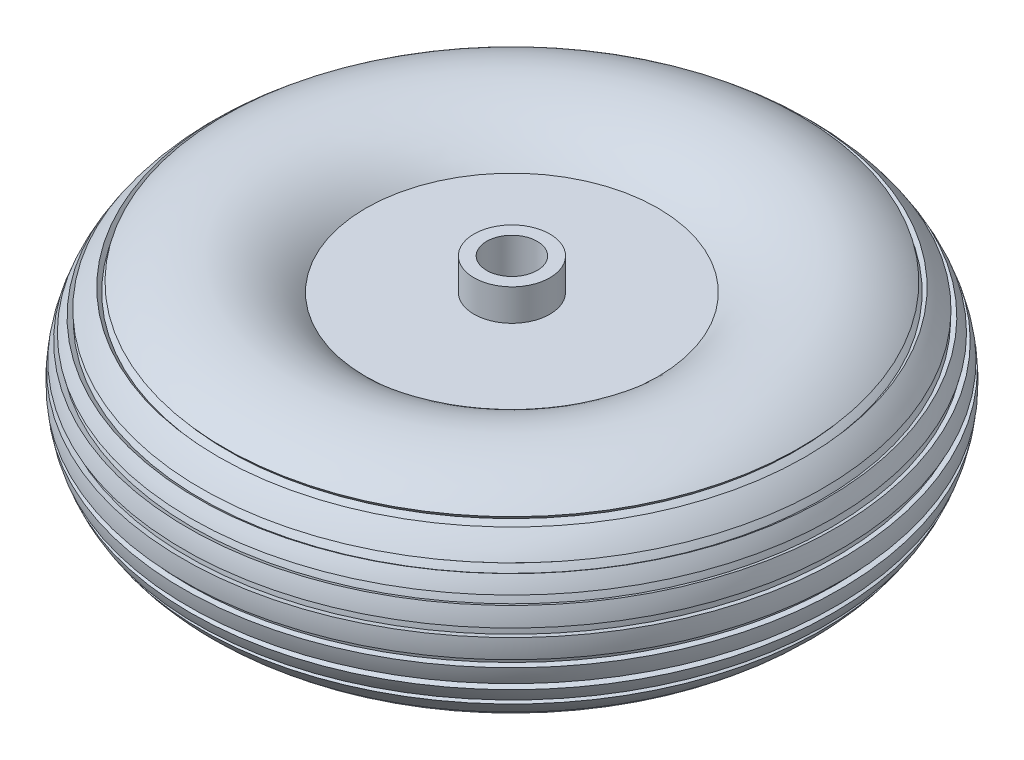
from build123d import *

# Parameters (mm, degrees)
SKETCH3_R           = 15
SKETCH3_R_2         = 10
BOSS_EXTRUDE1_DEPTH = 12.5
BOSS_EXTRUDE2_START = 12.5
SKETCH4_R           = 15
SKETCH4_R_2         = 10
BOSS_EXTRUDE2_DEPTH = 12.5


with BuildPart() as part:
    # Sketch2 → Revolve1 (revolve)
    with BuildSketch(Plane.YZ, mode=Mode.PRIVATE) as revolve1_sk:
        with BuildLine():
            ThreePointArc((-3.467976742, 62.934142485), (-4.969540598, 62.776480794), (-6.464166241, 62.562832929))
            Line((-6.464166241, 62.562832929), (-6.798959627, 64.628658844))
            ThreePointArc((-6.798959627, 64.628658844), (-10.127953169, 63.951609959), (-13.392236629, 63.010840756))
            Line((-13.392236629, 63.010840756), (-12.59221219, 61.071065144))
            ThreePointArc((-12.59221219, 61.071065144), (-14.008930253, 60.577117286), (-15.406334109, 60.030914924))
            Line((-15.406334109, 60.030914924), (-16.204262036, 61.965607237))
            ThreePointArc((-16.204262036, 61.965607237), (-18.972648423, 60.706118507), (-21.643870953, 59.251867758))
            Line((-21.643870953, 59.251867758), (-20.480648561, 57.508280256))
            ThreePointArc((-20.480648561, 57.508280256), (-21.744958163, 56.733326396), (-22.979980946, 55.912503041))
            Line((-22.979980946, 55.912503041), (-24.170164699, 57.633893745))
            ThreePointArc((-24.170164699, 57.633893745), (-28.149638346, 54.516994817), (-31.730906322, 50.949672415))
            Line((-31.730906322, 50.949672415), (-30.168417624, 49.557425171))
            ThreePointArc((-30.168417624, 49.557425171), (-31.121960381, 48.447456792), (-32.034688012, 47.303690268))
            Line((-32.034688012, 47.303690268), (-33.64639754, 48.64079966))
            ThreePointArc((-33.64639754, 48.64079966), (-42.41040785, 19.917882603), (-30, -7.427969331))
            Line((-30, -7.427969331), (-30, -51.79482847))
            Line((-30, -51.79482847), (-30, -55.176017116))
            Line((-30, -55.176017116), (30, -55.176017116))
            Line((30, -55.176017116), (30, -51.79482847))
            Line((30, -51.79482847), (30, -20.176017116))
            Line((30, -20.176017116), (30, -7.427969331))
            ThreePointArc((30, -7.427969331), (42.41040785, 19.917882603), (33.64639754, 48.64079966))
            Line((33.64639754, 48.64079966), (32.034688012, 47.303690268))
            ThreePointArc((32.034688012, 47.303690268), (31.121960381, 48.447456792), (30.168417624, 49.557425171))
            Line((30.168417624, 49.557425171), (31.730906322, 50.949672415))
            ThreePointArc((31.730906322, 50.949672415), (28.149638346, 54.516994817), (24.170164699, 57.633893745))
            Line((24.170164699, 57.633893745), (22.979980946, 55.912503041))
            ThreePointArc((22.979980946, 55.912503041), (21.744958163, 56.733326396), (20.480648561, 57.508280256))
            Line((20.480648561, 57.508280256), (21.643870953, 59.251867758))
            ThreePointArc((21.643870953, 59.251867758), (18.972648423, 60.706118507), (16.204262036, 61.965607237))
            Line((16.204262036, 61.965607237), (15.406334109, 60.030914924))
            ThreePointArc((15.406334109, 60.030914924), (14.008930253, 60.577117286), (12.59221219, 61.071065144))
            Line((12.59221219, 61.071065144), (13.392236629, 63.010840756))
            ThreePointArc((13.392236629, 63.010840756), (10.127953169, 63.951609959), (6.798959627, 64.628658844))
            Line((6.798959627, 64.628658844), (6.464166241, 62.562832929))
            ThreePointArc((6.464166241, 62.562832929), (4.969540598, 62.776480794), (3.467976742, 62.934142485))
            Line((3.467976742, 62.934142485), (3.798959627, 65.005887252))
            ThreePointArc((3.798959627, 65.005887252), (0, 65.176017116), (-3.798959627, 65.005887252))
            Line((-3.798959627, 65.005887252), (-3.467976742, 62.934142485))
        make_face()
    revolve(revolve1_sk.sketch.rotate(Axis((0, -30, -65.176017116), (0, 1, 0)), 180), axis=Axis((0, -30, -65.176017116), (0, 1, 0)))

    # Sketch3 → Boss-Extrude1 (add)
    with BuildSketch(Plane.XZ.offset(30)):
        with Locations(Location((0, -65.176017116, 0), (0, 0, 90))):
            Circle(SKETCH3_R)
        with Locations(Location((0, -65.176017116, 0), (0, 0, 270))):
            Circle(SKETCH3_R_2, mode=Mode.SUBTRACT)
    extrude(amount=BOSS_EXTRUDE1_DEPTH)

    # Sketch4 → Boss-Extrude2 (add)
    with BuildSketch(Plane(origin=(0, 30, 0), x_dir=(-1, 0, 0), z_dir=(0, 1, 0)).offset(BOSS_EXTRUDE2_START)):
        with Locations(Location((0, -65.176017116, 0), (0, 0, 90))):
            Circle(SKETCH4_R)
        with Locations(Location((0, -65.176017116, 0), (0, 0, 270))):
            Circle(SKETCH4_R_2, mode=Mode.SUBTRACT)
    extrude(amount=-BOSS_EXTRUDE2_DEPTH)


solid = part.part
